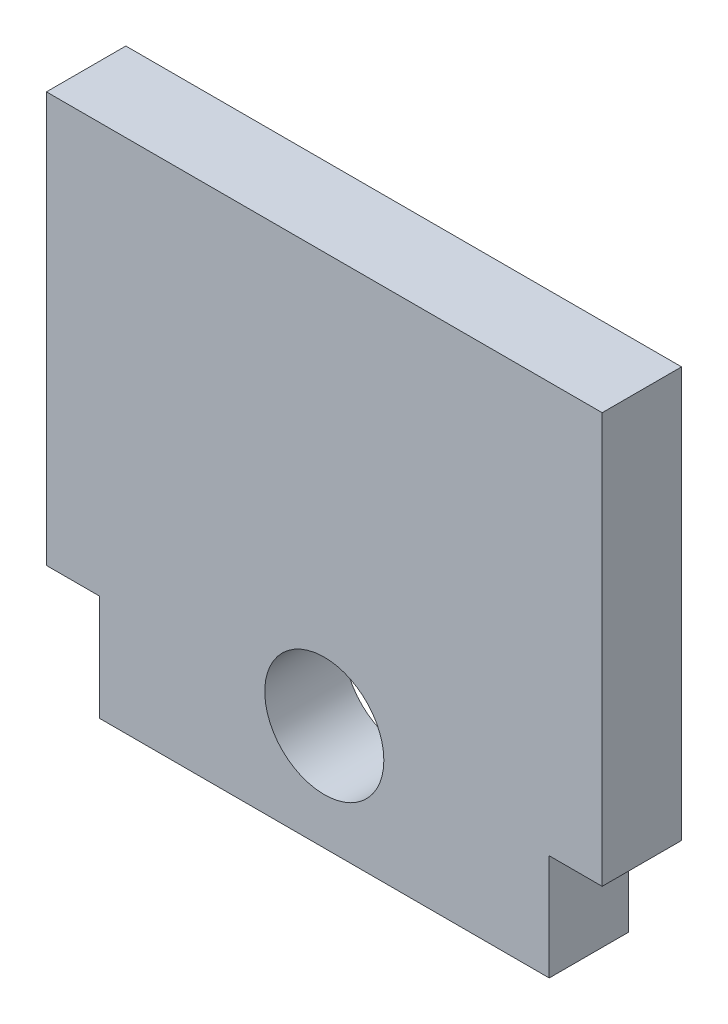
ISO-10303-21;
HEADER;
FILE_DESCRIPTION(('STEP AP214'),'2;1');
FILE_NAME('part.step','',(''),(''),'','','');
FILE_SCHEMA(('AUTOMOTIVE_DESIGN { 1 0 10303 214 1 1 1 1 }'));
ENDSEC;
DATA;
#1=APPLICATION_CONTEXT('core data for automotive mechanical design processes');
#2=APPLICATION_PROTOCOL_DEFINITION('international standard','automotive_design',2000,#1);
#3=PRODUCT_CONTEXT('',#1,'mechanical');
#4=PRODUCT('Part','Part','',(#3));
#5=PRODUCT_RELATED_PRODUCT_CATEGORY('part','',(#4));
#6=PRODUCT_DEFINITION_FORMATION('','',#4);
#7=PRODUCT_DEFINITION_CONTEXT('part definition',#1,'design');
#8=PRODUCT_DEFINITION('design','',#6,#7);
#9=PRODUCT_DEFINITION_SHAPE('','',#8);
#10=(LENGTH_UNIT() NAMED_UNIT(*) SI_UNIT(.MILLI.,.METRE.));
#11=(NAMED_UNIT(*) PLANE_ANGLE_UNIT() SI_UNIT($,.RADIAN.));
#12=(NAMED_UNIT(*) SI_UNIT($,.STERADIAN.) SOLID_ANGLE_UNIT());
#13=UNCERTAINTY_MEASURE_WITH_UNIT(LENGTH_MEASURE(1.E-05),#10,'distance_accuracy_value','');
#14=(GEOMETRIC_REPRESENTATION_CONTEXT(3) GLOBAL_UNCERTAINTY_ASSIGNED_CONTEXT((#13)) GLOBAL_UNIT_ASSIGNED_CONTEXT((#10,
#11,#12)) REPRESENTATION_CONTEXT('',''));
#15=CARTESIAN_POINT('',(0.,0.,0.));
#16=DIRECTION('',(0.,0.,1.));
#17=DIRECTION('',(1.,0.,0.));
#18=AXIS2_PLACEMENT_3D('',#15,#16,#17);
#19=CARTESIAN_POINT('',(0.,0.,6.));
#20=DIRECTION('',(0.,0.,-1.));
#21=DIRECTION('',(-1.,0.,0.));
#22=AXIS2_PLACEMENT_3D('',#19,#20,#21);
#23=PLANE('',#22);
#24=DIRECTION('',(1.,0.,0.));
#25=VECTOR('',#24,1.);
#26=CARTESIAN_POINT('',(34.,0.,6.));
#27=LINE('',#26,#25);
#28=CARTESIAN_POINT('',(0.,0.,6.));
#29=VERTEX_POINT('',#28);
#30=CARTESIAN_POINT('',(34.,0.,6.));
#31=VERTEX_POINT('',#30);
#32=EDGE_CURVE('E144',#29,#31,#27,.T.);
#33=ORIENTED_EDGE('',*,*,#32,.T.);
#34=DIRECTION('',(0.,1.,0.));
#35=VECTOR('',#34,1.);
#36=CARTESIAN_POINT('',(33.9999999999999,8.,6.));
#37=LINE('',#36,#35);
#38=CARTESIAN_POINT('',(33.9999999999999,8.,6.));
#39=VERTEX_POINT('',#38);
#40=EDGE_CURVE('E92',#31,#39,#37,.T.);
#41=ORIENTED_EDGE('',*,*,#40,.T.);
#42=DIRECTION('',(1.,0.,0.));
#43=VECTOR('',#42,1.);
#44=CARTESIAN_POINT('',(37.9999999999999,8.,6.));
#45=LINE('',#44,#43);
#46=CARTESIAN_POINT('',(37.9999999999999,8.,6.));
#47=VERTEX_POINT('',#46);
#48=EDGE_CURVE('E159',#39,#47,#45,.T.);
#49=ORIENTED_EDGE('',*,*,#48,.T.);
#50=DIRECTION('',(0.,1.,0.));
#51=VECTOR('',#50,1.);
#52=CARTESIAN_POINT('',(37.9999999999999,39.,6.));
#53=LINE('',#52,#51);
#54=CARTESIAN_POINT('',(37.9999999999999,39.,6.));
#55=VERTEX_POINT('',#54);
#56=EDGE_CURVE('E172',#47,#55,#53,.T.);
#57=ORIENTED_EDGE('',*,*,#56,.T.);
#58=DIRECTION('',(-1.,0.,0.));
#59=VECTOR('',#58,1.);
#60=CARTESIAN_POINT('',(-4.00000000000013,39.,6.));
#61=LINE('',#60,#59);
#62=CARTESIAN_POINT('',(-4.00000000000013,39.,6.));
#63=VERTEX_POINT('',#62);
#64=EDGE_CURVE('E111',#55,#63,#61,.T.);
#65=ORIENTED_EDGE('',*,*,#64,.T.);
#66=DIRECTION('',(0.,-1.,0.));
#67=VECTOR('',#66,1.);
#68=CARTESIAN_POINT('',(-4.,8.,6.));
#69=LINE('',#68,#67);
#70=CARTESIAN_POINT('',(-4.,8.,6.));
#71=VERTEX_POINT('',#70);
#72=EDGE_CURVE('E105',#63,#71,#69,.T.);
#73=ORIENTED_EDGE('',*,*,#72,.T.);
#74=DIRECTION('',(1.,0.,0.));
#75=VECTOR('',#74,1.);
#76=CARTESIAN_POINT('',(0.,8.,6.));
#77=LINE('',#76,#75);
#78=CARTESIAN_POINT('',(0.,8.,6.));
#79=VERTEX_POINT('',#78);
#80=EDGE_CURVE('E109',#71,#79,#77,.T.);
#81=ORIENTED_EDGE('',*,*,#80,.T.);
#82=DIRECTION('',(0.,-1.,0.));
#83=VECTOR('',#82,1.);
#84=CARTESIAN_POINT('',(0.,0.,6.));
#85=LINE('',#84,#83);
#86=EDGE_CURVE('E49',#79,#29,#85,.T.);
#87=ORIENTED_EDGE('',*,*,#86,.T.);
#88=EDGE_LOOP('',(#33,#41,#49,#57,#65,#73,#81,#87));
#89=FACE_BOUND('',#88,.T.);
#90=CARTESIAN_POINT('',(16.9999999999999,8.,6.));
#91=DIRECTION('',(0.,0.,1.));
#92=DIRECTION('',(1.,0.,0.));
#93=AXIS2_PLACEMENT_3D('',#90,#91,#92);
#94=CIRCLE('',#93,4.5);
#95=CARTESIAN_POINT('',(21.4999999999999,8.,6.));
#96=VERTEX_POINT('',#95);
#97=EDGE_CURVE('E133',#96,#96,#94,.T.);
#98=ORIENTED_EDGE('',*,*,#97,.F.);
#99=EDGE_LOOP('',(#98));
#100=FACE_BOUND('',#99,.T.);
#101=ADVANCED_FACE('F32',(#89,#100),#23,.F.);
#102=CARTESIAN_POINT('',(0.,0.,0.));
#103=DIRECTION('',(0.,0.,-1.));
#104=DIRECTION('',(-1.,0.,0.));
#105=AXIS2_PLACEMENT_3D('',#102,#103,#104);
#106=PLANE('',#105);
#107=DIRECTION('',(1.,0.,0.));
#108=VECTOR('',#107,1.);
#109=CARTESIAN_POINT('',(34.,0.,0.));
#110=LINE('',#109,#108);
#111=CARTESIAN_POINT('',(0.,0.,0.));
#112=VERTEX_POINT('',#111);
#113=CARTESIAN_POINT('',(34.,0.,0.));
#114=VERTEX_POINT('',#113);
#115=EDGE_CURVE('E129',#112,#114,#110,.T.);
#116=ORIENTED_EDGE('',*,*,#115,.F.);
#117=DIRECTION('',(0.,-1.,0.));
#118=VECTOR('',#117,1.);
#119=CARTESIAN_POINT('',(0.,0.,0.));
#120=LINE('',#119,#118);
#121=CARTESIAN_POINT('',(0.,8.,0.));
#122=VERTEX_POINT('',#121);
#123=EDGE_CURVE('E84',#122,#112,#120,.T.);
#124=ORIENTED_EDGE('',*,*,#123,.F.);
#125=DIRECTION('',(1.,0.,0.));
#126=VECTOR('',#125,1.);
#127=CARTESIAN_POINT('',(0.,8.,0.));
#128=LINE('',#127,#126);
#129=CARTESIAN_POINT('',(-4.,8.,0.));
#130=VERTEX_POINT('',#129);
#131=EDGE_CURVE('E78',#130,#122,#128,.T.);
#132=ORIENTED_EDGE('',*,*,#131,.F.);
#133=DIRECTION('',(0.,-1.,0.));
#134=VECTOR('',#133,1.);
#135=CARTESIAN_POINT('',(-4.,8.,0.));
#136=LINE('',#135,#134);
#137=CARTESIAN_POINT('',(-4.00000000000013,39.,0.));
#138=VERTEX_POINT('',#137);
#139=EDGE_CURVE('E119',#138,#130,#136,.T.);
#140=ORIENTED_EDGE('',*,*,#139,.F.);
#141=DIRECTION('',(-1.,0.,0.));
#142=VECTOR('',#141,1.);
#143=CARTESIAN_POINT('',(-4.00000000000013,39.,0.));
#144=LINE('',#143,#142);
#145=CARTESIAN_POINT('',(37.9999999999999,39.,0.));
#146=VERTEX_POINT('',#145);
#147=EDGE_CURVE('E139',#146,#138,#144,.T.);
#148=ORIENTED_EDGE('',*,*,#147,.F.);
#149=DIRECTION('',(0.,1.,0.));
#150=VECTOR('',#149,1.);
#151=CARTESIAN_POINT('',(37.9999999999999,39.,0.));
#152=LINE('',#151,#150);
#153=CARTESIAN_POINT('',(37.9999999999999,8.,0.));
#154=VERTEX_POINT('',#153);
#155=EDGE_CURVE('E137',#154,#146,#152,.T.);
#156=ORIENTED_EDGE('',*,*,#155,.F.);
#157=DIRECTION('',(1.,0.,0.));
#158=VECTOR('',#157,1.);
#159=CARTESIAN_POINT('',(37.9999999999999,8.,0.));
#160=LINE('',#159,#158);
#161=CARTESIAN_POINT('',(33.9999999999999,8.,0.));
#162=VERTEX_POINT('',#161);
#163=EDGE_CURVE('E135',#162,#154,#160,.T.);
#164=ORIENTED_EDGE('',*,*,#163,.F.);
#165=DIRECTION('',(0.,1.,0.));
#166=VECTOR('',#165,1.);
#167=CARTESIAN_POINT('',(33.9999999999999,8.,0.));
#168=LINE('',#167,#166);
#169=EDGE_CURVE('E132',#114,#162,#168,.T.);
#170=ORIENTED_EDGE('',*,*,#169,.F.);
#171=EDGE_LOOP('',(#116,#124,#132,#140,#148,#156,#164,#170));
#172=FACE_BOUND('',#171,.T.);
#173=CARTESIAN_POINT('',(16.9999999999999,8.,0.));
#174=DIRECTION('',(0.,0.,1.));
#175=DIRECTION('',(1.,0.,0.));
#176=AXIS2_PLACEMENT_3D('',#173,#174,#175);
#177=CIRCLE('',#176,4.5);
#178=CARTESIAN_POINT('',(21.4999999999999,8.,0.));
#179=VERTEX_POINT('',#178);
#180=EDGE_CURVE('E178',#179,#179,#177,.T.);
#181=ORIENTED_EDGE('',*,*,#180,.T.);
#182=EDGE_LOOP('',(#181));
#183=FACE_BOUND('',#182,.T.);
#184=ADVANCED_FACE('F163',(#172,#183),#106,.T.);
#185=CARTESIAN_POINT('',(34.,0.,6.));
#186=DIRECTION('',(0.,1.,0.));
#187=DIRECTION('',(-1.,0.,0.));
#188=AXIS2_PLACEMENT_3D('',#185,#186,#187);
#189=PLANE('',#188);
#190=ORIENTED_EDGE('',*,*,#115,.T.);
#191=DIRECTION('',(0.,0.,-1.));
#192=VECTOR('',#191,1.);
#193=CARTESIAN_POINT('',(34.,0.,6.));
#194=LINE('',#193,#192);
#195=EDGE_CURVE('E11',#31,#114,#194,.T.);
#196=ORIENTED_EDGE('',*,*,#195,.F.);
#197=ORIENTED_EDGE('',*,*,#32,.F.);
#198=DIRECTION('',(0.,0.,-1.));
#199=VECTOR('',#198,1.);
#200=CARTESIAN_POINT('',(0.,0.,6.));
#201=LINE('',#200,#199);
#202=EDGE_CURVE('E125',#29,#112,#201,.T.);
#203=ORIENTED_EDGE('',*,*,#202,.T.);
#204=EDGE_LOOP('',(#190,#196,#197,#203));
#205=FACE_BOUND('',#204,.T.);
#206=ADVANCED_FACE('F34',(#205),#189,.F.);
#207=CARTESIAN_POINT('',(33.9999999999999,8.,6.));
#208=DIRECTION('',(-1.,0.,0.));
#209=DIRECTION('',(0.,-1.,0.));
#210=AXIS2_PLACEMENT_3D('',#207,#208,#209);
#211=PLANE('',#210);
#212=ORIENTED_EDGE('',*,*,#169,.T.);
#213=DIRECTION('',(0.,0.,-1.));
#214=VECTOR('',#213,1.);
#215=CARTESIAN_POINT('',(33.9999999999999,8.,6.));
#216=LINE('',#215,#214);
#217=EDGE_CURVE('E41',#39,#162,#216,.T.);
#218=ORIENTED_EDGE('',*,*,#217,.F.);
#219=ORIENTED_EDGE('',*,*,#40,.F.);
#220=ORIENTED_EDGE('',*,*,#195,.T.);
#221=EDGE_LOOP('',(#212,#218,#219,#220));
#222=FACE_BOUND('',#221,.T.);
#223=ADVANCED_FACE('F206',(#222),#211,.F.);
#224=CARTESIAN_POINT('',(37.9999999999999,8.,6.));
#225=DIRECTION('',(0.,1.,0.));
#226=DIRECTION('',(0.,0.,1.));
#227=AXIS2_PLACEMENT_3D('',#224,#225,#226);
#228=PLANE('',#227);
#229=ORIENTED_EDGE('',*,*,#163,.T.);
#230=DIRECTION('',(0.,0.,-1.));
#231=VECTOR('',#230,1.);
#232=CARTESIAN_POINT('',(37.9999999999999,8.,6.));
#233=LINE('',#232,#231);
#234=EDGE_CURVE('E151',#47,#154,#233,.T.);
#235=ORIENTED_EDGE('',*,*,#234,.F.);
#236=ORIENTED_EDGE('',*,*,#48,.F.);
#237=ORIENTED_EDGE('',*,*,#217,.T.);
#238=EDGE_LOOP('',(#229,#235,#236,#237));
#239=FACE_BOUND('',#238,.T.);
#240=ADVANCED_FACE('F157',(#239),#228,.F.);
#241=CARTESIAN_POINT('',(37.9999999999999,39.,6.));
#242=DIRECTION('',(-1.,0.,0.));
#243=DIRECTION('',(0.,-1.,0.));
#244=AXIS2_PLACEMENT_3D('',#241,#242,#243);
#245=PLANE('',#244);
#246=ORIENTED_EDGE('',*,*,#155,.T.);
#247=DIRECTION('',(0.,0.,-1.));
#248=VECTOR('',#247,1.);
#249=CARTESIAN_POINT('',(37.9999999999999,39.,6.));
#250=LINE('',#249,#248);
#251=EDGE_CURVE('E148',#55,#146,#250,.T.);
#252=ORIENTED_EDGE('',*,*,#251,.F.);
#253=ORIENTED_EDGE('',*,*,#56,.F.);
#254=ORIENTED_EDGE('',*,*,#234,.T.);
#255=EDGE_LOOP('',(#246,#252,#253,#254));
#256=FACE_BOUND('',#255,.T.);
#257=ADVANCED_FACE('F168',(#256),#245,.F.);
#258=CARTESIAN_POINT('',(-4.00000000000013,39.,6.));
#259=DIRECTION('',(0.,-1.,0.));
#260=DIRECTION('',(1.,0.,0.));
#261=AXIS2_PLACEMENT_3D('',#258,#259,#260);
#262=PLANE('',#261);
#263=ORIENTED_EDGE('',*,*,#147,.T.);
#264=DIRECTION('',(0.,0.,-1.));
#265=VECTOR('',#264,1.);
#266=CARTESIAN_POINT('',(-4.00000000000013,39.,6.));
#267=LINE('',#266,#265);
#268=EDGE_CURVE('E120',#63,#138,#267,.T.);
#269=ORIENTED_EDGE('',*,*,#268,.F.);
#270=ORIENTED_EDGE('',*,*,#64,.F.);
#271=ORIENTED_EDGE('',*,*,#251,.T.);
#272=EDGE_LOOP('',(#263,#269,#270,#271));
#273=FACE_BOUND('',#272,.T.);
#274=ADVANCED_FACE('F171',(#273),#262,.F.);
#275=CARTESIAN_POINT('',(-4.,8.,6.));
#276=DIRECTION('',(1.,0.,0.));
#277=DIRECTION('',(0.,1.,0.));
#278=AXIS2_PLACEMENT_3D('',#275,#276,#277);
#279=PLANE('',#278);
#280=ORIENTED_EDGE('',*,*,#139,.T.);
#281=DIRECTION('',(0.,0.,-1.));
#282=VECTOR('',#281,1.);
#283=CARTESIAN_POINT('',(-4.,8.,6.));
#284=LINE('',#283,#282);
#285=EDGE_CURVE('E116',#71,#130,#284,.T.);
#286=ORIENTED_EDGE('',*,*,#285,.F.);
#287=ORIENTED_EDGE('',*,*,#72,.F.);
#288=ORIENTED_EDGE('',*,*,#268,.T.);
#289=EDGE_LOOP('',(#280,#286,#287,#288));
#290=FACE_BOUND('',#289,.T.);
#291=ADVANCED_FACE('F117',(#290),#279,.F.);
#292=CARTESIAN_POINT('',(0.,8.,6.));
#293=DIRECTION('',(0.,1.,0.));
#294=DIRECTION('',(-1.,0.,0.));
#295=AXIS2_PLACEMENT_3D('',#292,#293,#294);
#296=PLANE('',#295);
#297=ORIENTED_EDGE('',*,*,#131,.T.);
#298=DIRECTION('',(0.,0.,-1.));
#299=VECTOR('',#298,1.);
#300=CARTESIAN_POINT('',(0.,8.,6.));
#301=LINE('',#300,#299);
#302=EDGE_CURVE('E121',#79,#122,#301,.T.);
#303=ORIENTED_EDGE('',*,*,#302,.F.);
#304=ORIENTED_EDGE('',*,*,#80,.F.);
#305=ORIENTED_EDGE('',*,*,#285,.T.);
#306=EDGE_LOOP('',(#297,#303,#304,#305));
#307=FACE_BOUND('',#306,.T.);
#308=ADVANCED_FACE('F123',(#307),#296,.F.);
#309=CARTESIAN_POINT('',(0.,0.,6.));
#310=DIRECTION('',(1.,0.,0.));
#311=DIRECTION('',(0.,0.,-1.));
#312=AXIS2_PLACEMENT_3D('',#309,#310,#311);
#313=PLANE('',#312);
#314=ORIENTED_EDGE('',*,*,#123,.T.);
#315=ORIENTED_EDGE('',*,*,#202,.F.);
#316=ORIENTED_EDGE('',*,*,#86,.F.);
#317=ORIENTED_EDGE('',*,*,#302,.T.);
#318=EDGE_LOOP('',(#314,#315,#316,#317));
#319=FACE_BOUND('',#318,.T.);
#320=ADVANCED_FACE('F194',(#319),#313,.F.);
#321=CARTESIAN_POINT('',(16.9999999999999,8.,6.));
#322=DIRECTION('',(0.,0.,-1.));
#323=DIRECTION('',(-1.,0.,0.));
#324=AXIS2_PLACEMENT_3D('',#321,#322,#323);
#325=CYLINDRICAL_SURFACE('',#324,4.5);
#326=ORIENTED_EDGE('',*,*,#97,.T.);
#327=EDGE_LOOP('',(#326));
#328=FACE_BOUND('',#327,.T.);
#329=ORIENTED_EDGE('',*,*,#180,.F.);
#330=EDGE_LOOP('',(#329));
#331=FACE_BOUND('',#330,.T.);
#332=ADVANCED_FACE('F184',(#328,#331),#325,.F.);
#333=CLOSED_SHELL('',(#101,#184,#206,#223,#240,#257,#274,#291,#308,#320,#332));
#334=MANIFOLD_SOLID_BREP('B2',#333);
#335=ADVANCED_BREP_SHAPE_REPRESENTATION('',(#18,#334),#14);
#336=SHAPE_DEFINITION_REPRESENTATION(#9,#335);
ENDSEC;
END-ISO-10303-21;
